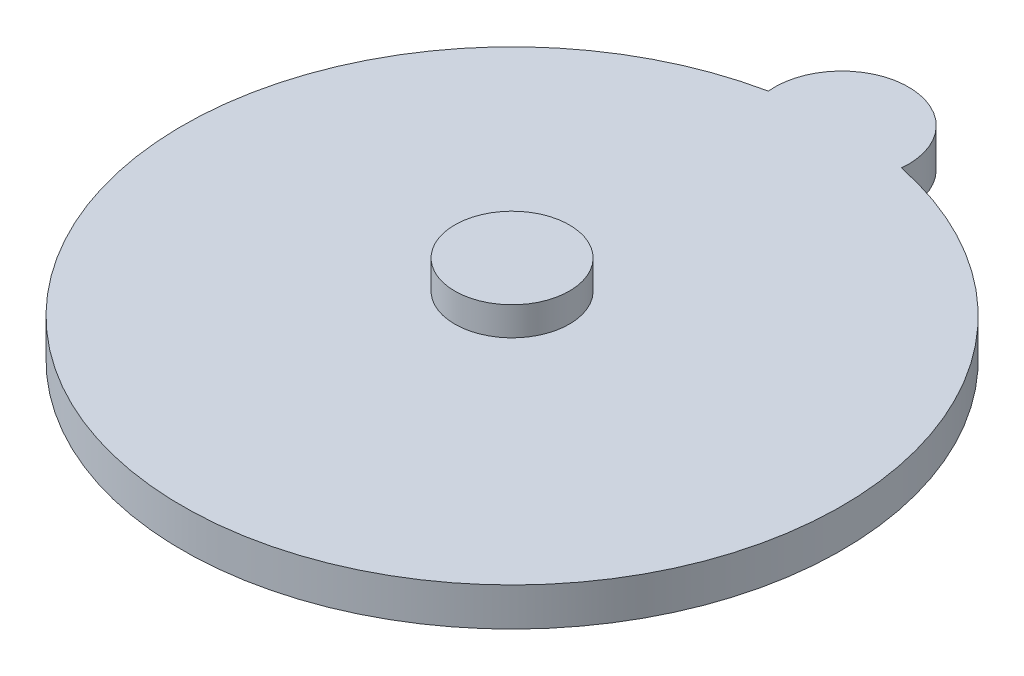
ISO-10303-21;
HEADER;
FILE_DESCRIPTION(('STEP AP214'),'2;1');
FILE_NAME('part.step','',(''),(''),'','','');
FILE_SCHEMA(('AUTOMOTIVE_DESIGN { 1 0 10303 214 1 1 1 1 }'));
ENDSEC;
DATA;
#1=APPLICATION_CONTEXT('core data for automotive mechanical design processes');
#2=APPLICATION_PROTOCOL_DEFINITION('international standard','automotive_design',2000,#1);
#3=PRODUCT_CONTEXT('',#1,'mechanical');
#4=PRODUCT('Part','Part','',(#3));
#5=PRODUCT_RELATED_PRODUCT_CATEGORY('part','',(#4));
#6=PRODUCT_DEFINITION_FORMATION('','',#4);
#7=PRODUCT_DEFINITION_CONTEXT('part definition',#1,'design');
#8=PRODUCT_DEFINITION('design','',#6,#7);
#9=PRODUCT_DEFINITION_SHAPE('','',#8);
#10=(LENGTH_UNIT() NAMED_UNIT(*) SI_UNIT(.MILLI.,.METRE.));
#11=(NAMED_UNIT(*) PLANE_ANGLE_UNIT() SI_UNIT($,.RADIAN.));
#12=(NAMED_UNIT(*) SI_UNIT($,.STERADIAN.) SOLID_ANGLE_UNIT());
#13=UNCERTAINTY_MEASURE_WITH_UNIT(LENGTH_MEASURE(1.E-05),#10,'distance_accuracy_value','');
#14=(GEOMETRIC_REPRESENTATION_CONTEXT(3) GLOBAL_UNCERTAINTY_ASSIGNED_CONTEXT((#13)) GLOBAL_UNIT_ASSIGNED_CONTEXT((#10,
#11,#12)) REPRESENTATION_CONTEXT('',''));
#15=CARTESIAN_POINT('',(0.,0.,0.));
#16=DIRECTION('',(0.,0.,1.));
#17=DIRECTION('',(1.,0.,0.));
#18=AXIS2_PLACEMENT_3D('',#15,#16,#17);
#19=CARTESIAN_POINT('',(0.,4.,-34.5));
#20=DIRECTION('',(0.,-1.,0.));
#21=DIRECTION('',(0.,0.,-1.));
#22=AXIS2_PLACEMENT_3D('',#19,#20,#21);
#23=CYLINDRICAL_SURFACE('',#22,7.);
#24=CARTESIAN_POINT('',(0.,0.,-34.5));
#25=DIRECTION('',(0.,1.,0.));
#26=DIRECTION('',(0.,0.,1.));
#27=AXIS2_PLACEMENT_3D('',#24,#25,#26);
#28=CIRCLE('',#27,7.);
#29=CARTESIAN_POINT('',(6.96388499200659,0.,-33.7898550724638));
#30=VERTEX_POINT('',#29);
#31=CARTESIAN_POINT('',(-6.96388499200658,0.,-33.7898550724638));
#32=VERTEX_POINT('',#31);
#33=EDGE_CURVE('E66',#30,#32,#28,.T.);
#34=ORIENTED_EDGE('',*,*,#33,.T.);
#35=DIRECTION('',(0.,-1.,0.));
#36=VECTOR('',#35,1.);
#37=CARTESIAN_POINT('',(-6.96388499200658,4.,-33.7898550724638));
#38=LINE('',#37,#36);
#39=CARTESIAN_POINT('',(-6.96388499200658,4.,-33.7898550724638));
#40=VERTEX_POINT('',#39);
#41=EDGE_CURVE('E11',#40,#32,#38,.T.);
#42=ORIENTED_EDGE('',*,*,#41,.F.);
#43=CARTESIAN_POINT('',(0.,4.,-34.5));
#44=DIRECTION('',(0.,1.,0.));
#45=DIRECTION('',(0.,0.,1.));
#46=AXIS2_PLACEMENT_3D('',#43,#44,#45);
#47=CIRCLE('',#46,7.);
#48=CARTESIAN_POINT('',(6.96388499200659,4.,-33.7898550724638));
#49=VERTEX_POINT('',#48);
#50=EDGE_CURVE('E65',#49,#40,#47,.T.);
#51=ORIENTED_EDGE('',*,*,#50,.F.);
#52=DIRECTION('',(0.,-1.,0.));
#53=VECTOR('',#52,1.);
#54=CARTESIAN_POINT('',(6.96388499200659,4.,-33.7898550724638));
#55=LINE('',#54,#53);
#56=EDGE_CURVE('E43',#49,#30,#55,.T.);
#57=ORIENTED_EDGE('',*,*,#56,.T.);
#58=EDGE_LOOP('',(#34,#42,#51,#57));
#59=FACE_BOUND('',#58,.T.);
#60=ADVANCED_FACE('F35',(#59),#23,.T.);
#61=CARTESIAN_POINT('',(0.,4.,0.));
#62=DIRECTION('',(0.,-1.,0.));
#63=DIRECTION('',(0.,0.,-1.));
#64=AXIS2_PLACEMENT_3D('',#61,#62,#63);
#65=CYLINDRICAL_SURFACE('',#64,34.5);
#66=CARTESIAN_POINT('',(0.,0.,0.));
#67=DIRECTION('',(0.,1.,0.));
#68=DIRECTION('',(0.,0.,1.));
#69=AXIS2_PLACEMENT_3D('',#66,#67,#68);
#70=CIRCLE('',#69,34.5);
#71=EDGE_CURVE('E58',#32,#30,#70,.T.);
#72=ORIENTED_EDGE('',*,*,#71,.T.);
#73=ORIENTED_EDGE('',*,*,#56,.F.);
#74=CARTESIAN_POINT('',(0.,4.,0.));
#75=DIRECTION('',(0.,1.,0.));
#76=DIRECTION('',(0.,0.,1.));
#77=AXIS2_PLACEMENT_3D('',#74,#75,#76);
#78=CIRCLE('',#77,34.5);
#79=EDGE_CURVE('E50',#40,#49,#78,.T.);
#80=ORIENTED_EDGE('',*,*,#79,.F.);
#81=ORIENTED_EDGE('',*,*,#41,.T.);
#82=EDGE_LOOP('',(#72,#73,#80,#81));
#83=FACE_BOUND('',#82,.T.);
#84=ADVANCED_FACE('F61',(#83),#65,.T.);
#85=CARTESIAN_POINT('',(0.,4.,-17.25));
#86=DIRECTION('',(0.,1.,0.));
#87=DIRECTION('',(0.,0.,1.));
#88=AXIS2_PLACEMENT_3D('',#85,#86,#87);
#89=PLANE('',#88);
#90=CARTESIAN_POINT('',(0.,4.,0.));
#91=DIRECTION('',(0.,1.,0.));
#92=DIRECTION('',(0.,0.,1.));
#93=AXIS2_PLACEMENT_3D('',#90,#91,#92);
#94=CIRCLE('',#93,1.625);
#95=CARTESIAN_POINT('',(0.,4.,1.625));
#96=VERTEX_POINT('',#95);
#97=EDGE_CURVE('E73',#96,#96,#94,.T.);
#98=ORIENTED_EDGE('',*,*,#97,.F.);
#99=EDGE_LOOP('',(#98));
#100=FACE_BOUND('',#99,.T.);
#101=ORIENTED_EDGE('',*,*,#50,.T.);
#102=ORIENTED_EDGE('',*,*,#79,.T.);
#103=EDGE_LOOP('',(#101,#102));
#104=FACE_BOUND('',#103,.T.);
#105=ADVANCED_FACE('F108',(#100,#104),#89,.T.);
#106=CARTESIAN_POINT('',(0.,0.,-17.25));
#107=DIRECTION('',(0.,1.,0.));
#108=DIRECTION('',(0.,0.,1.));
#109=AXIS2_PLACEMENT_3D('',#106,#107,#108);
#110=PLANE('',#109);
#111=ORIENTED_EDGE('',*,*,#33,.F.);
#112=ORIENTED_EDGE('',*,*,#71,.F.);
#113=EDGE_LOOP('',(#111,#112));
#114=FACE_BOUND('',#113,.T.);
#115=ADVANCED_FACE('F69',(#114),#110,.F.);
#116=CARTESIAN_POINT('',(0.,6.25,0.));
#117=DIRECTION('',(0.,-1.,0.));
#118=DIRECTION('',(0.,0.,-1.));
#119=AXIS2_PLACEMENT_3D('',#116,#117,#118);
#120=CYLINDRICAL_SURFACE('',#119,1.625);
#121=CARTESIAN_POINT('',(0.,6.25,0.));
#122=DIRECTION('',(0.,1.,0.));
#123=DIRECTION('',(0.,0.,1.));
#124=AXIS2_PLACEMENT_3D('',#121,#122,#123);
#125=CIRCLE('',#124,1.625);
#126=CARTESIAN_POINT('',(0.,6.25,1.625));
#127=VERTEX_POINT('',#126);
#128=EDGE_CURVE('E70',#127,#127,#125,.T.);
#129=ORIENTED_EDGE('',*,*,#128,.F.);
#130=EDGE_LOOP('',(#129));
#131=FACE_BOUND('',#130,.T.);
#132=ORIENTED_EDGE('',*,*,#97,.T.);
#133=EDGE_LOOP('',(#132));
#134=FACE_BOUND('',#133,.T.);
#135=ADVANCED_FACE('F92',(#131,#134),#120,.T.);
#136=CARTESIAN_POINT('',(0.,9.25,0.));
#137=DIRECTION('',(0.,-1.,0.));
#138=DIRECTION('',(0.,0.,-1.));
#139=AXIS2_PLACEMENT_3D('',#136,#137,#138);
#140=CYLINDRICAL_SURFACE('',#139,6.);
#141=CARTESIAN_POINT('',(0.,9.25,0.));
#142=DIRECTION('',(0.,1.,0.));
#143=DIRECTION('',(0.,0.,1.));
#144=AXIS2_PLACEMENT_3D('',#141,#142,#143);
#145=CIRCLE('',#144,6.);
#146=CARTESIAN_POINT('',(0.,9.25,6.));
#147=VERTEX_POINT('',#146);
#148=EDGE_CURVE('E79',#147,#147,#145,.T.);
#149=ORIENTED_EDGE('',*,*,#148,.F.);
#150=EDGE_LOOP('',(#149));
#151=FACE_BOUND('',#150,.T.);
#152=CARTESIAN_POINT('',(0.,6.25,0.));
#153=DIRECTION('',(0.,1.,0.));
#154=DIRECTION('',(0.,0.,1.));
#155=AXIS2_PLACEMENT_3D('',#152,#153,#154);
#156=CIRCLE('',#155,6.);
#157=CARTESIAN_POINT('',(0.,6.25,6.));
#158=VERTEX_POINT('',#157);
#159=EDGE_CURVE('E81',#158,#158,#156,.T.);
#160=ORIENTED_EDGE('',*,*,#159,.T.);
#161=EDGE_LOOP('',(#160));
#162=FACE_BOUND('',#161,.T.);
#163=ADVANCED_FACE('F89',(#151,#162),#140,.T.);
#164=CARTESIAN_POINT('',(0.,9.25,0.));
#165=DIRECTION('',(0.,1.,0.));
#166=DIRECTION('',(0.,0.,1.));
#167=AXIS2_PLACEMENT_3D('',#164,#165,#166);
#168=PLANE('',#167);
#169=ORIENTED_EDGE('',*,*,#148,.T.);
#170=EDGE_LOOP('',(#169));
#171=FACE_BOUND('',#170,.T.);
#172=ADVANCED_FACE('F87',(#171),#168,.T.);
#173=CARTESIAN_POINT('',(0.,6.25,0.));
#174=DIRECTION('',(0.,1.,0.));
#175=DIRECTION('',(0.,0.,1.));
#176=AXIS2_PLACEMENT_3D('',#173,#174,#175);
#177=PLANE('',#176);
#178=ORIENTED_EDGE('',*,*,#128,.T.);
#179=EDGE_LOOP('',(#178));
#180=FACE_BOUND('',#179,.T.);
#181=ORIENTED_EDGE('',*,*,#159,.F.);
#182=EDGE_LOOP('',(#181));
#183=FACE_BOUND('',#182,.T.);
#184=ADVANCED_FACE('F96',(#180,#183),#177,.F.);
#185=CLOSED_SHELL('',(#60,#84,#105,#115,#135,#163,#172,#184));
#186=MANIFOLD_SOLID_BREP('B2',#185);
#187=ADVANCED_BREP_SHAPE_REPRESENTATION('',(#18,#186),#14);
#188=SHAPE_DEFINITION_REPRESENTATION(#9,#187);
ENDSEC;
END-ISO-10303-21;
